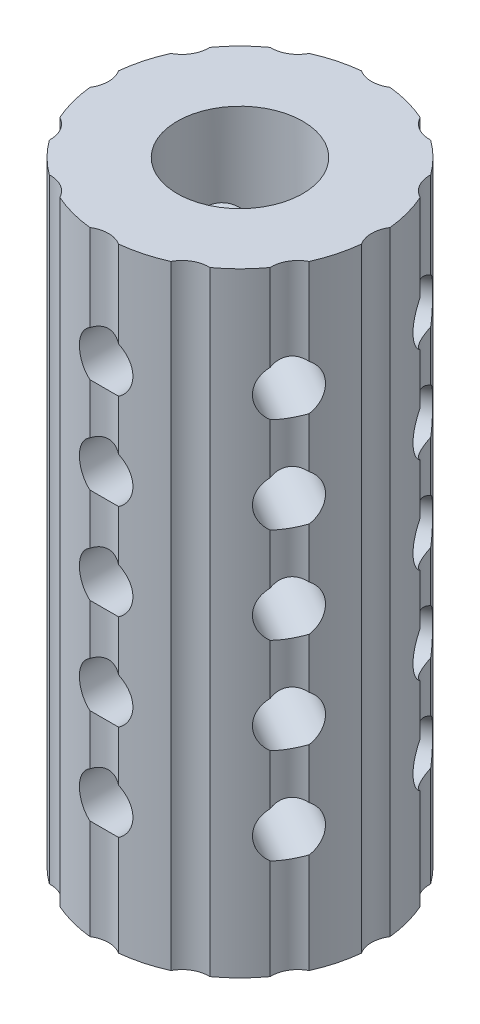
from build123d import *

# Parameters (mm, degrees)
SKETCH3_W                            = 1.2446
SKETCH3_H                            = 2.54
SKETCH5_W                            = 1.2446
SKETCH5_H                            = 6.35
F_40_0_098_DIAMETER_HOLE1_AT_2_COUNT = 2
F_40_0_098_DIAMETER_HOLE1_AT_2_PITCH = 4.445
F_40_0_098_DIAMETER_HOLE1_AT_3_COUNT = 2
F_40_0_098_DIAMETER_HOLE1_AT_3_PITCH = 8.89
F_40_0_098_DIAMETER_HOLE1_AT_4_COUNT = 2
F_40_0_098_DIAMETER_HOLE1_AT_4_PITCH = 13.335
F_40_0_098_DIAMETER_HOLE1_AT_5_COUNT = 2
F_40_0_098_DIAMETER_HOLE1_AT_5_PITCH = 17.78
CIRPATTERN1_COUNT                    = 4
CIRPATTERN2_COUNT                    = 6
CIRPATTERN2_COPY_1_SKETCH_W          = 1.2446
CIRPATTERN2_COPY_1_SKETCH_H          = 6.35
CIRPATTERN2_COPY_2_SKETCH_W          = 1.2446
CIRPATTERN2_COPY_2_SKETCH_H          = 6.35
CIRPATTERN2_COPY_3_SKETCH_W          = 1.2446
CIRPATTERN2_COPY_3_SKETCH_H          = 6.35
CIRPATTERN2_COPY_4_SKETCH_W          = 1.2446
CIRPATTERN2_COPY_4_SKETCH_H          = 6.35
CIRPATTERN2_COPY_5_SKETCH_W          = 1.2446
CIRPATTERN2_COPY_5_SKETCH_H          = 6.35
CIRPATTERN2_COPY_6_SKETCH_W          = 1.2446
CIRPATTERN2_COPY_6_SKETCH_H          = 6.35
CIRPATTERN2_COPY_7_SKETCH_W          = 1.2446
CIRPATTERN2_COPY_7_SKETCH_H          = 6.35
CIRPATTERN2_COPY_8_SKETCH_W          = 1.2446
CIRPATTERN2_COPY_8_SKETCH_H          = 6.35
CIRPATTERN2_COPY_9_SKETCH_W          = 1.2446
CIRPATTERN2_COPY_9_SKETCH_H          = 6.35
CIRPATTERN2_COPY_10_SKETCH_W         = 1.2446
CIRPATTERN2_COPY_10_SKETCH_H         = 6.35
CIRPATTERN2_COPY_11_SKETCH_W         = 1.2446
CIRPATTERN2_COPY_11_SKETCH_H         = 6.35
CIRPATTERN2_COPY_12_SKETCH_W         = 1.2446
CIRPATTERN2_COPY_12_SKETCH_H         = 6.35
CIRPATTERN2_COPY_13_SKETCH_W         = 1.2446
CIRPATTERN2_COPY_13_SKETCH_H         = 6.35
CIRPATTERN2_COPY_14_SKETCH_W         = 1.2446
CIRPATTERN2_COPY_14_SKETCH_H         = 6.35
CIRPATTERN2_COPY_15_SKETCH_W         = 1.2446
CIRPATTERN2_COPY_15_SKETCH_H         = 6.35
CIRPATTERN2_COPY_16_SKETCH_W         = 1.2446
CIRPATTERN2_COPY_16_SKETCH_H         = 6.35
CIRPATTERN2_COPY_17_SKETCH_W         = 1.2446
CIRPATTERN2_COPY_17_SKETCH_H         = 6.35
CIRPATTERN2_COPY_18_SKETCH_W         = 1.2446
CIRPATTERN2_COPY_18_SKETCH_H         = 6.35
CIRPATTERN2_COPY_19_SKETCH_W         = 1.2446
CIRPATTERN2_COPY_19_SKETCH_H         = 6.35
CIRPATTERN2_COPY_20_SKETCH_W         = 1.2446
CIRPATTERN2_COPY_20_SKETCH_H         = 6.35
F_40_0_098_DIAMETER_HOLE3_D          = 2.4892
CIRPATTERN3_COUNT                    = 12


with BuildPart() as part:
    # Sketch1 → Revolve1 (revolve)
    with BuildSketch(Plane.XY, mode=Mode.PRIVATE) as revolve1_sk:
        Polygon((0, 0), (0, 2.54), (2.921, 2.54), (2.921, 28.575), (6.35, 28.575), (6.35, 0), align=None)
    revolve(revolve1_sk.sketch.rotate(Axis((0, -0.137809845, 0), (0, 1, 0)), 90), axis=Axis((0, -0.137809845, 0), (0, 1, 0)))

    # Sketch3 → 40 _0.098_ Diameter Hole2 (revolve, cut)
    with BuildSketch(Plane(origin=(2.286, 2.54, 0), x_dir=(0, 0, 1), z_dir=(1, 0, 0))):
        with Locations((0.6223, 1.27)):
            Rectangle(SKETCH3_W, SKETCH3_H)
    f_40_0_098_diameter_hole2 = revolve(axis=Axis((2.286, 8.89, 0), (0, -1, 0)), mode=Mode.SUBTRACT)

    # Sketch5 → 40 _0.098_ Diameter Hole1 (revolve, cut)
    with BuildSketch(Plane(origin=(0, 5.715, 0), x_dir=(0, 1, 0), z_dir=(1, 0, 0))):
        with Locations((0.6223, 3.175)):
            Rectangle(SKETCH5_W, SKETCH5_H)
    f_40_0_098_diameter_hole1 = revolve(axis=Axis((0, 5.715, -6.35), (0, 0, 1)), mode=Mode.SUBTRACT)

    # 40 _0.098_ Diameter Hole1 at 2: 40 _0.098_ Diameter Hole1 ×2
    with Locations(*[(0, i * F_40_0_098_DIAMETER_HOLE1_AT_2_PITCH, 0) for i in range(1, F_40_0_098_DIAMETER_HOLE1_AT_2_COUNT)]):
        add(f_40_0_098_diameter_hole1, mode=Mode.SUBTRACT)

    # 40 _0.098_ Diameter Hole1 at 3: 40 _0.098_ Diameter Hole1 ×2
    with Locations(*[(0, i * F_40_0_098_DIAMETER_HOLE1_AT_3_PITCH, 0) for i in range(1, F_40_0_098_DIAMETER_HOLE1_AT_3_COUNT)]):
        add(f_40_0_098_diameter_hole1, mode=Mode.SUBTRACT)

    # 40 _0.098_ Diameter Hole1 at 4: 40 _0.098_ Diameter Hole1 ×2
    with Locations(*[(0, i * F_40_0_098_DIAMETER_HOLE1_AT_4_PITCH, 0) for i in range(1, F_40_0_098_DIAMETER_HOLE1_AT_4_COUNT)]):
        add(f_40_0_098_diameter_hole1, mode=Mode.SUBTRACT)

    # 40 _0.098_ Diameter Hole1 at 5: 40 _0.098_ Diameter Hole1 ×2
    with Locations(*[(0, i * F_40_0_098_DIAMETER_HOLE1_AT_5_PITCH, 0) for i in range(1, F_40_0_098_DIAMETER_HOLE1_AT_5_COUNT)]):
        add(f_40_0_098_diameter_hole1, mode=Mode.SUBTRACT)

    # CirPattern1: 40 _0.098_ Diameter Hole2 ×4 about axis
    cirpattern1_axis = Axis((0, 0, 0), (0, 1, 0))
    for i in range(1, CIRPATTERN1_COUNT):
        add(f_40_0_098_diameter_hole2.rotate(cirpattern1_axis, i * 360 / CIRPATTERN1_COUNT), mode=Mode.SUBTRACT)

    # CirPattern2: 40 _0.098_ Diameter Hole1 ×6 about axis
    cirpattern2_axis = Axis((0, -0.137809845, 0), (0, 1, 0))
    for i in range(1, CIRPATTERN2_COUNT):
        add(f_40_0_098_diameter_hole1.rotate(cirpattern2_axis, i * 360 / CIRPATTERN2_COUNT), mode=Mode.SUBTRACT)

    # CirPattern2 copy 1 sketch → CirPattern2 copy 1 (revolve, cut)
    with BuildSketch(Plane(origin=(0, 10.16, 0), x_dir=(0, 1, 0), z_dir=(0.5000000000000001, 0, -0.8660254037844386))):
        with Locations((0.6223, 3.175)):
            Rectangle(CIRPATTERN2_COPY_1_SKETCH_W, CIRPATTERN2_COPY_1_SKETCH_H)
    revolve(axis=Axis((-5.499261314, 10.16, -3.175), (0.8660254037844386, 0, 0.5000000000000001)), mode=Mode.SUBTRACT)

    # CirPattern2 copy 2 sketch → CirPattern2 copy 2 (revolve, cut)
    with BuildSketch(Plane(origin=(0, 10.16, 0), x_dir=(0, 1, 0), z_dir=(-0.4999999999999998, 0, -0.8660254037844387))):
        with Locations((0.6223, 3.175)):
            Rectangle(CIRPATTERN2_COPY_2_SKETCH_W, CIRPATTERN2_COPY_2_SKETCH_H)
    revolve(axis=Axis((-5.499261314, 10.16, 3.175), (0.8660254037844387, 0, -0.4999999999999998)), mode=Mode.SUBTRACT)

    # CirPattern2 copy 3 sketch → CirPattern2 copy 3 (revolve, cut)
    with BuildSketch(Plane(origin=(0, 10.16, 0), x_dir=(0, 1, 0), z_dir=(-1, 0, 0))):
        with Locations((0.6223, 3.175)):
            Rectangle(CIRPATTERN2_COPY_3_SKETCH_W, CIRPATTERN2_COPY_3_SKETCH_H)
    revolve(axis=Axis((0, 10.16, 6.35), (0, 0, -1)), mode=Mode.SUBTRACT)

    # CirPattern2 copy 4 sketch → CirPattern2 copy 4 (revolve, cut)
    with BuildSketch(Plane(origin=(0, 10.16, 0), x_dir=(0, 1, 0), z_dir=(-0.5000000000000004, 0, 0.8660254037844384))):
        with Locations((0.6223, 3.175)):
            Rectangle(CIRPATTERN2_COPY_4_SKETCH_W, CIRPATTERN2_COPY_4_SKETCH_H)
    revolve(axis=Axis((5.499261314, 10.16, 3.175), (-0.8660254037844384, 0, -0.5000000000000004)), mode=Mode.SUBTRACT)

    # CirPattern2 copy 5 sketch → CirPattern2 copy 5 (revolve, cut)
    with BuildSketch(Plane(origin=(0, 10.16, 0), x_dir=(0, 1, 0), z_dir=(0.5000000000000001, 0, 0.8660254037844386))):
        with Locations((0.6223, 3.175)):
            Rectangle(CIRPATTERN2_COPY_5_SKETCH_W, CIRPATTERN2_COPY_5_SKETCH_H)
    revolve(axis=Axis((5.499261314, 10.16, -3.175), (-0.8660254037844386, 0, 0.5000000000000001)), mode=Mode.SUBTRACT)

    # CirPattern2 copy 6 sketch → CirPattern2 copy 6 (revolve, cut)
    with BuildSketch(Plane(origin=(0, 14.605, 0), x_dir=(0, 1, 0), z_dir=(0.5000000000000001, 0, -0.8660254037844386))):
        with Locations((0.6223, 3.175)):
            Rectangle(CIRPATTERN2_COPY_6_SKETCH_W, CIRPATTERN2_COPY_6_SKETCH_H)
    revolve(axis=Axis((-5.499261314, 14.605, -3.175), (0.8660254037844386, 0, 0.5000000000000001)), mode=Mode.SUBTRACT)

    # CirPattern2 copy 7 sketch → CirPattern2 copy 7 (revolve, cut)
    with BuildSketch(Plane(origin=(0, 14.605, 0), x_dir=(0, 1, 0), z_dir=(-0.4999999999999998, 0, -0.8660254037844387))):
        with Locations((0.6223, 3.175)):
            Rectangle(CIRPATTERN2_COPY_7_SKETCH_W, CIRPATTERN2_COPY_7_SKETCH_H)
    revolve(axis=Axis((-5.499261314, 14.605, 3.175), (0.8660254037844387, 0, -0.4999999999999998)), mode=Mode.SUBTRACT)

    # CirPattern2 copy 8 sketch → CirPattern2 copy 8 (revolve, cut)
    with BuildSketch(Plane(origin=(0, 14.605, 0), x_dir=(0, 1, 0), z_dir=(-1, 0, 0))):
        with Locations((0.6223, 3.175)):
            Rectangle(CIRPATTERN2_COPY_8_SKETCH_W, CIRPATTERN2_COPY_8_SKETCH_H)
    revolve(axis=Axis((0, 14.605, 6.35), (0, 0, -1)), mode=Mode.SUBTRACT)

    # CirPattern2 copy 9 sketch → CirPattern2 copy 9 (revolve, cut)
    with BuildSketch(Plane(origin=(0, 14.605, 0), x_dir=(0, 1, 0), z_dir=(-0.5000000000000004, 0, 0.8660254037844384))):
        with Locations((0.6223, 3.175)):
            Rectangle(CIRPATTERN2_COPY_9_SKETCH_W, CIRPATTERN2_COPY_9_SKETCH_H)
    revolve(axis=Axis((5.499261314, 14.605, 3.175), (-0.8660254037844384, 0, -0.5000000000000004)), mode=Mode.SUBTRACT)

    # CirPattern2 copy 10 sketch → CirPattern2 copy 10 (revolve, cut)
    with BuildSketch(Plane(origin=(0, 14.605, 0), x_dir=(0, 1, 0), z_dir=(0.5000000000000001, 0, 0.8660254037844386))):
        with Locations((0.6223, 3.175)):
            Rectangle(CIRPATTERN2_COPY_10_SKETCH_W, CIRPATTERN2_COPY_10_SKETCH_H)
    revolve(axis=Axis((5.499261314, 14.605, -3.175), (-0.8660254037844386, 0, 0.5000000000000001)), mode=Mode.SUBTRACT)

    # CirPattern2 copy 11 sketch → CirPattern2 copy 11 (revolve, cut)
    with BuildSketch(Plane(origin=(0, 19.05, 0), x_dir=(0, 1, 0), z_dir=(0.5000000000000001, 0, -0.8660254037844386))):
        with Locations((0.6223, 3.175)):
            Rectangle(CIRPATTERN2_COPY_11_SKETCH_W, CIRPATTERN2_COPY_11_SKETCH_H)
    revolve(axis=Axis((-5.499261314, 19.05, -3.175), (0.8660254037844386, 0, 0.5000000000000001)), mode=Mode.SUBTRACT)

    # CirPattern2 copy 12 sketch → CirPattern2 copy 12 (revolve, cut)
    with BuildSketch(Plane(origin=(0, 19.05, 0), x_dir=(0, 1, 0), z_dir=(-0.4999999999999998, 0, -0.8660254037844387))):
        with Locations((0.6223, 3.175)):
            Rectangle(CIRPATTERN2_COPY_12_SKETCH_W, CIRPATTERN2_COPY_12_SKETCH_H)
    revolve(axis=Axis((-5.499261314, 19.05, 3.175), (0.8660254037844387, 0, -0.4999999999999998)), mode=Mode.SUBTRACT)

    # CirPattern2 copy 13 sketch → CirPattern2 copy 13 (revolve, cut)
    with BuildSketch(Plane(origin=(0, 19.05, 0), x_dir=(0, 1, 0), z_dir=(-1, 0, 0))):
        with Locations((0.6223, 3.175)):
            Rectangle(CIRPATTERN2_COPY_13_SKETCH_W, CIRPATTERN2_COPY_13_SKETCH_H)
    revolve(axis=Axis((0, 19.05, 6.35), (0, 0, -1)), mode=Mode.SUBTRACT)

    # CirPattern2 copy 14 sketch → CirPattern2 copy 14 (revolve, cut)
    with BuildSketch(Plane(origin=(0, 19.05, 0), x_dir=(0, 1, 0), z_dir=(-0.5000000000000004, 0, 0.8660254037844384))):
        with Locations((0.6223, 3.175)):
            Rectangle(CIRPATTERN2_COPY_14_SKETCH_W, CIRPATTERN2_COPY_14_SKETCH_H)
    revolve(axis=Axis((5.499261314, 19.05, 3.175), (-0.8660254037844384, 0, -0.5000000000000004)), mode=Mode.SUBTRACT)

    # CirPattern2 copy 15 sketch → CirPattern2 copy 15 (revolve, cut)
    with BuildSketch(Plane(origin=(0, 19.05, 0), x_dir=(0, 1, 0), z_dir=(0.5000000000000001, 0, 0.8660254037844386))):
        with Locations((0.6223, 3.175)):
            Rectangle(CIRPATTERN2_COPY_15_SKETCH_W, CIRPATTERN2_COPY_15_SKETCH_H)
    revolve(axis=Axis((5.499261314, 19.05, -3.175), (-0.8660254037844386, 0, 0.5000000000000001)), mode=Mode.SUBTRACT)

    # CirPattern2 copy 16 sketch → CirPattern2 copy 16 (revolve, cut)
    with BuildSketch(Plane(origin=(0, 23.495, 0), x_dir=(0, 1, 0), z_dir=(0.5000000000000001, 0, -0.8660254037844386))):
        with Locations((0.6223, 3.175)):
            Rectangle(CIRPATTERN2_COPY_16_SKETCH_W, CIRPATTERN2_COPY_16_SKETCH_H)
    revolve(axis=Axis((-5.499261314, 23.495, -3.175), (0.8660254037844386, 0, 0.5000000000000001)), mode=Mode.SUBTRACT)

    # CirPattern2 copy 17 sketch → CirPattern2 copy 17 (revolve, cut)
    with BuildSketch(Plane(origin=(0, 23.495, 0), x_dir=(0, 1, 0), z_dir=(-0.4999999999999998, 0, -0.8660254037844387))):
        with Locations((0.6223, 3.175)):
            Rectangle(CIRPATTERN2_COPY_17_SKETCH_W, CIRPATTERN2_COPY_17_SKETCH_H)
    revolve(axis=Axis((-5.499261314, 23.495, 3.175), (0.8660254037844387, 0, -0.4999999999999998)), mode=Mode.SUBTRACT)

    # CirPattern2 copy 18 sketch → CirPattern2 copy 18 (revolve, cut)
    with BuildSketch(Plane(origin=(0, 23.495, 0), x_dir=(0, 1, 0), z_dir=(-1, 0, 0))):
        with Locations((0.6223, 3.175)):
            Rectangle(CIRPATTERN2_COPY_18_SKETCH_W, CIRPATTERN2_COPY_18_SKETCH_H)
    revolve(axis=Axis((0, 23.495, 6.35), (0, 0, -1)), mode=Mode.SUBTRACT)

    # CirPattern2 copy 19 sketch → CirPattern2 copy 19 (revolve, cut)
    with BuildSketch(Plane(origin=(0, 23.495, 0), x_dir=(0, 1, 0), z_dir=(-0.5000000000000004, 0, 0.8660254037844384))):
        with Locations((0.6223, 3.175)):
            Rectangle(CIRPATTERN2_COPY_19_SKETCH_W, CIRPATTERN2_COPY_19_SKETCH_H)
    revolve(axis=Axis((5.499261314, 23.495, 3.175), (-0.8660254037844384, 0, -0.5000000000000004)), mode=Mode.SUBTRACT)

    # CirPattern2 copy 20 sketch → CirPattern2 copy 20 (revolve, cut)
    with BuildSketch(Plane(origin=(0, 23.495, 0), x_dir=(0, 1, 0), z_dir=(0.5000000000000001, 0, 0.8660254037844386))):
        with Locations((0.6223, 3.175)):
            Rectangle(CIRPATTERN2_COPY_20_SKETCH_W, CIRPATTERN2_COPY_20_SKETCH_H)
    revolve(axis=Axis((5.499261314, 23.495, -3.175), (-0.8660254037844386, 0, 0.5000000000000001)), mode=Mode.SUBTRACT)

    # 40 _0.098_ Diameter Hole3 (through all)
    with Locations(Plane(origin=(0, 0, 0), x_dir=(-1, 0, 0), z_dir=(0, -1, 0))):
        with Locations((-7.366, 0)):
            f_40_0_098_diameter_hole3 = Hole(F_40_0_098_DIAMETER_HOLE3_D / 2)

    # CirPattern3: 40 _0.098_ Diameter Hole3 ×12 about axis
    cirpattern3_axis = Axis((0, 0, 0), (0, 1, 0))
    for i in range(1, CIRPATTERN3_COUNT):
        add(f_40_0_098_diameter_hole3.rotate(cirpattern3_axis, i * 360 / CIRPATTERN3_COUNT), mode=Mode.SUBTRACT)


solid = part.part
